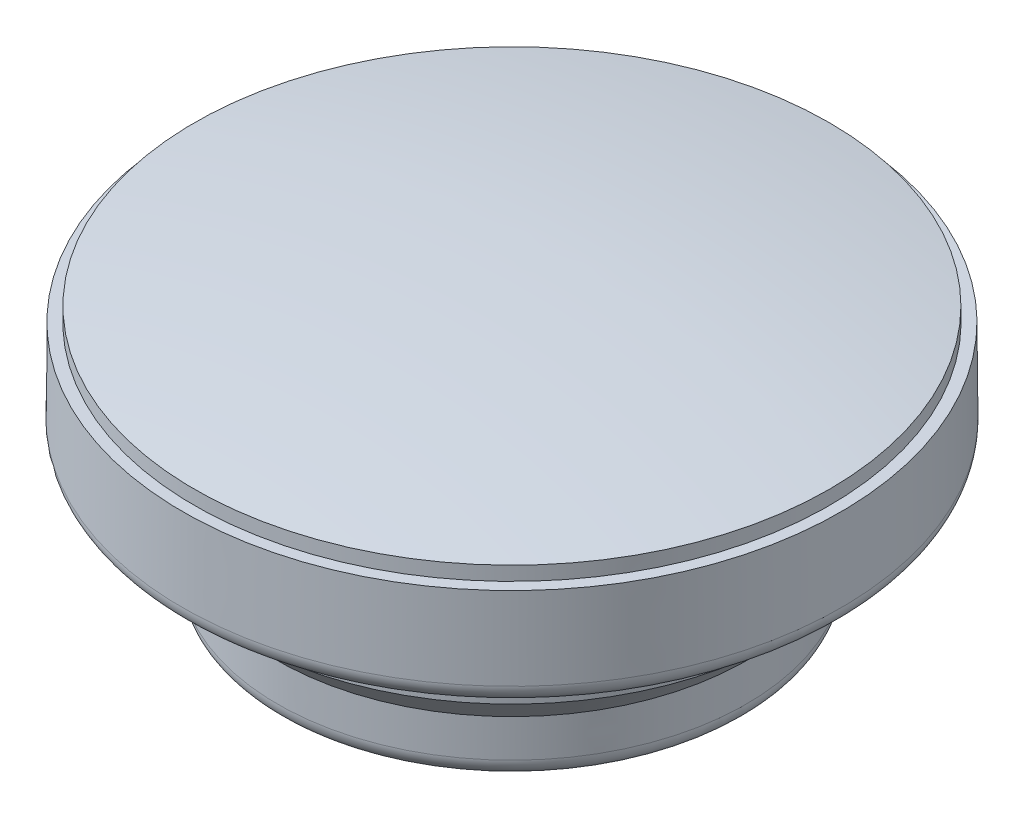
ISO-10303-21;
HEADER;
FILE_DESCRIPTION(('STEP AP214'),'2;1');
FILE_NAME('part.step','',(''),(''),'','','');
FILE_SCHEMA(('AUTOMOTIVE_DESIGN { 1 0 10303 214 1 1 1 1 }'));
ENDSEC;
DATA;
#1=APPLICATION_CONTEXT('core data for automotive mechanical design processes');
#2=APPLICATION_PROTOCOL_DEFINITION('international standard','automotive_design',2000,#1);
#3=PRODUCT_CONTEXT('',#1,'mechanical');
#4=PRODUCT('Part','Part','',(#3));
#5=PRODUCT_RELATED_PRODUCT_CATEGORY('part','',(#4));
#6=PRODUCT_DEFINITION_FORMATION('','',#4);
#7=PRODUCT_DEFINITION_CONTEXT('part definition',#1,'design');
#8=PRODUCT_DEFINITION('design','',#6,#7);
#9=PRODUCT_DEFINITION_SHAPE('','',#8);
#10=(LENGTH_UNIT() NAMED_UNIT(*) SI_UNIT(.MILLI.,.METRE.));
#11=(NAMED_UNIT(*) PLANE_ANGLE_UNIT() SI_UNIT($,.RADIAN.));
#12=(NAMED_UNIT(*) SI_UNIT($,.STERADIAN.) SOLID_ANGLE_UNIT());
#13=UNCERTAINTY_MEASURE_WITH_UNIT(LENGTH_MEASURE(1.E-05),#10,'distance_accuracy_value','');
#14=(GEOMETRIC_REPRESENTATION_CONTEXT(3) GLOBAL_UNCERTAINTY_ASSIGNED_CONTEXT((#13)) GLOBAL_UNIT_ASSIGNED_CONTEXT((#10,
#11,#12)) REPRESENTATION_CONTEXT('',''));
#15=CARTESIAN_POINT('',(0.,0.,0.));
#16=DIRECTION('',(0.,0.,1.));
#17=DIRECTION('',(1.,0.,0.));
#18=AXIS2_PLACEMENT_3D('',#15,#16,#17);
#19=CARTESIAN_POINT('',(3.33066907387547E-13,-49.9999999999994,-8.88178419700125E-13));
#20=DIRECTION('',(0.,-1.,0.));
#21=DIRECTION('',(1.00000000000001,0.,0.));
#22=AXIS2_PLACEMENT_3D('',#19,#20,#21);
#23=SPHERICAL_SURFACE('',#22,50.);
#24=CARTESIAN_POINT('',(-4.9960036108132E-13,-0.723172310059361,0.));
#25=DIRECTION('',(0.,-1.,0.));
#26=DIRECTION('',(0.,0.,-1.00000000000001));
#27=AXIS2_PLACEMENT_3D('',#24,#25,#26);
#28=CIRCLE('',#27,8.47314893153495);
#29=CARTESIAN_POINT('',(-5.04774257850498E-13,-0.72317231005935,-8.473148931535));
#30=VERTEX_POINT('',#29);
#31=EDGE_CURVE('E82',#30,#30,#28,.T.);
#32=ORIENTED_EDGE('',*,*,#31,.F.);
#33=EDGE_LOOP('',(#32));
#34=FACE_BOUND('',#33,.T.);
#35=ADVANCED_FACE('F30',(#34),#23,.T.);
#36=CARTESIAN_POINT('',(3.33066907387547E-13,-49.9999999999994,-8.88178419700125E-13));
#37=DIRECTION('',(0.,-1.,0.));
#38=DIRECTION('',(1.00000000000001,0.,0.));
#39=AXIS2_PLACEMENT_3D('',#36,#37,#38);
#40=SPHERICAL_SURFACE('',#39,47.);
#41=CARTESIAN_POINT('',(-1.66533453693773E-13,-3.14791410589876,-5.55111512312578E-13));
#42=DIRECTION('',(0.,-1.,0.));
#43=DIRECTION('',(0.,0.,-1.00000000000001));
#44=AXIS2_PLACEMENT_3D('',#41,#42,#43);
#45=CIRCLE('',#44,3.72586196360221);
#46=CARTESIAN_POINT('',(-1.68808549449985E-13,-3.14791410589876,-3.72586196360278));
#47=VERTEX_POINT('',#46);
#48=EDGE_CURVE('E10',#47,#47,#45,.T.);
#49=ORIENTED_EDGE('',*,*,#48,.T.);
#50=EDGE_LOOP('',(#49));
#51=FACE_BOUND('',#50,.T.);
#52=ADVANCED_FACE('F90',(#51),#40,.F.);
#53=CARTESIAN_POINT('',(3.33066907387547E-13,-3.1860909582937,-1.11022302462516E-13));
#54=DIRECTION('',(0.,-1.,0.));
#55=DIRECTION('',(0.,0.,-1.00000000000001));
#56=AXIS2_PLACEMENT_3D('',#53,#54,#55);
#57=CONICAL_SURFACE('',#56,4.17826761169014,0.0174532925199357);
#58=CARTESIAN_POINT('',(-2.22044604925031E-13,-6.80436293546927,0.));
#59=DIRECTION('',(0.,1.,0.));
#60=DIRECTION('',(0.,0.,1.00000000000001));
#61=AXIS2_PLACEMENT_3D('',#58,#59,#60);
#62=CIRCLE('',#61,4.24142478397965);
#63=CARTESIAN_POINT('',(-2.19454694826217E-13,-6.80436293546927,4.24142478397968));
#64=VERTEX_POINT('',#63);
#65=EDGE_CURVE('E49',#64,#64,#62,.F.);
#66=ORIENTED_EDGE('',*,*,#65,.T.);
#67=EDGE_LOOP('',(#66));
#68=FACE_BOUND('',#67,.T.);
#69=CARTESIAN_POINT('',(-4.44089209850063E-13,-3.63761434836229,-5.55111512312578E-13));
#70=DIRECTION('',(0.,-1.,0.));
#71=DIRECTION('',(0.,0.,-1.00000000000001));
#72=AXIS2_PLACEMENT_3D('',#69,#70,#71);
#73=CIRCLE('',#72,4.18614898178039);
#74=CARTESIAN_POINT('',(-4.46645367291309E-13,-3.63761434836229,-4.18614898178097));
#75=VERTEX_POINT('',#74);
#76=EDGE_CURVE('E52',#75,#75,#73,.F.);
#77=ORIENTED_EDGE('',*,*,#76,.T.);
#78=EDGE_LOOP('',(#77));
#79=FACE_BOUND('',#78,.T.);
#80=ADVANCED_FACE('F94',(#68,#79),#57,.F.);
#81=CARTESIAN_POINT('',(6.24999999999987,-7.29563673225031,0.));
#82=DIRECTION('',(0.,-1.,0.));
#83=DIRECTION('',(0.,0.,-1.00000000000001));
#84=AXIS2_PLACEMENT_3D('',#81,#82,#83);
#85=PLANE('',#84);
#86=CARTESIAN_POINT('',(0.,-7.29563673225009,-1.11022302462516E-13));
#87=DIRECTION('',(0.,-1.,0.));
#88=DIRECTION('',(0.,0.,-1.00000000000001));
#89=AXIS2_PLACEMENT_3D('',#86,#87,#88);
#90=CIRCLE('',#89,4.74134863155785);
#91=CARTESIAN_POINT('',(0.,-7.29563673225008,-4.74134863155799));
#92=VERTEX_POINT('',#91);
#93=EDGE_CURVE('E40',#92,#92,#90,.F.);
#94=ORIENTED_EDGE('',*,*,#93,.T.);
#95=EDGE_LOOP('',(#94));
#96=FACE_BOUND('',#95,.T.);
#97=CARTESIAN_POINT('',(0.,-7.29563673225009,-1.11022302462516E-13));
#98=DIRECTION('',(0.,-1.,0.));
#99=DIRECTION('',(0.,0.,-1.00000000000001));
#100=AXIS2_PLACEMENT_3D('',#97,#98,#99);
#101=CIRCLE('',#100,5.75434439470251);
#102=CARTESIAN_POINT('',(0.,-7.29563673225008,-5.75434439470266));
#103=VERTEX_POINT('',#102);
#104=EDGE_CURVE('E44',#103,#103,#101,.T.);
#105=ORIENTED_EDGE('',*,*,#104,.T.);
#106=EDGE_LOOP('',(#105));
#107=FACE_BOUND('',#106,.T.);
#108=ADVANCED_FACE('F98',(#96,#107),#85,.T.);
#109=CARTESIAN_POINT('',(0.,-7.29563673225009,-1.11022302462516E-13));
#110=DIRECTION('',(0.,1.,0.));
#111=DIRECTION('',(0.,0.,1.00000000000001));
#112=AXIS2_PLACEMENT_3D('',#109,#110,#111);
#113=CONICAL_SURFACE('',#112,6.25,0.00872664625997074);
#114=CARTESIAN_POINT('',(-2.22044604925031E-13,-6.79999999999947,-4.44089209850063E-13));
#115=DIRECTION('',(0.,-1.,0.));
#116=DIRECTION('',(0.,0.,-1.00000000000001));
#117=AXIS2_PLACEMENT_3D('',#114,#115,#116);
#118=CIRCLE('',#117,6.2543253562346);
#119=CARTESIAN_POINT('',(-2.25863637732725E-13,-6.79999999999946,-6.25432535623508));
#120=VERTEX_POINT('',#119);
#121=EDGE_CURVE('E36',#120,#120,#118,.F.);
#122=ORIENTED_EDGE('',*,*,#121,.T.);
#123=EDGE_LOOP('',(#122));
#124=FACE_BOUND('',#123,.T.);
#125=CARTESIAN_POINT('',(0.,-5.78683286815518,0.));
#126=DIRECTION('',(0.,-1.,0.));
#127=DIRECTION('',(0.,0.,-1.00000000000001));
#128=AXIS2_PLACEMENT_3D('',#125,#126,#127);
#129=CIRCLE('',#128,6.26316713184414);
#130=CARTESIAN_POINT('',(0.,-5.78683286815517,-6.26316713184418));
#131=VERTEX_POINT('',#130);
#132=EDGE_CURVE('E55',#131,#131,#129,.T.);
#133=ORIENTED_EDGE('',*,*,#132,.T.);
#134=EDGE_LOOP('',(#133));
#135=FACE_BOUND('',#134,.T.);
#136=ADVANCED_FACE('F104',(#124,#135),#113,.T.);
#137=CARTESIAN_POINT('',(0.,-5.78683286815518,0.));
#138=DIRECTION('',(0.,1.,0.));
#139=DIRECTION('',(0.,0.,1.00000000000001));
#140=AXIS2_PLACEMENT_3D('',#137,#138,#139);
#141=CONICAL_SURFACE('',#140,6.26316713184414,0.785398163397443);
#142=CARTESIAN_POINT('',(-4.44089209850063E-13,-4.79999999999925,2.22044604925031E-13));
#143=DIRECTION('',(0.,-1.,0.));
#144=DIRECTION('',(0.,0.,-1.00000000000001));
#145=AXIS2_PLACEMENT_3D('',#142,#143,#144);
#146=CIRCLE('',#145,7.25);
#147=CARTESIAN_POINT('',(-4.48516224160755E-13,-4.79999999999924,-7.24999999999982));
#148=VERTEX_POINT('',#147);
#149=EDGE_CURVE('E58',#148,#148,#146,.T.);
#150=ORIENTED_EDGE('',*,*,#149,.T.);
#151=EDGE_LOOP('',(#150));
#152=FACE_BOUND('',#151,.T.);
#153=ORIENTED_EDGE('',*,*,#132,.F.);
#154=EDGE_LOOP('',(#153));
#155=FACE_BOUND('',#154,.T.);
#156=ADVANCED_FACE('F108',(#152,#155),#141,.T.);
#157=CARTESIAN_POINT('',(-4.44089209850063E-13,-4.79999999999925,2.22044604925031E-13));
#158=DIRECTION('',(0.,1.,0.));
#159=DIRECTION('',(0.,0.,1.00000000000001));
#160=AXIS2_PLACEMENT_3D('',#157,#158,#159);
#161=CONICAL_SURFACE('',#160,7.25,0.0174532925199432);
#162=CARTESIAN_POINT('',(0.,-3.29999999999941,0.));
#163=DIRECTION('',(0.,-1.,0.));
#164=DIRECTION('',(0.,0.,-1.00000000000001));
#165=AXIS2_PLACEMENT_3D('',#162,#163,#164);
#166=CIRCLE('',#165,7.27618259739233);
#167=CARTESIAN_POINT('',(0.,-3.29999999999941,-7.27618259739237));
#168=VERTEX_POINT('',#167);
#169=EDGE_CURVE('E61',#168,#168,#166,.T.);
#170=ORIENTED_EDGE('',*,*,#169,.T.);
#171=EDGE_LOOP('',(#170));
#172=FACE_BOUND('',#171,.T.);
#173=ORIENTED_EDGE('',*,*,#149,.F.);
#174=EDGE_LOOP('',(#173));
#175=FACE_BOUND('',#174,.T.);
#176=ADVANCED_FACE('F111',(#172,#175),#161,.T.);
#177=CARTESIAN_POINT('',(7.77618259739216,-3.29999999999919,-3.33066907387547E-13));
#178=DIRECTION('',(0.,-1.,0.));
#179=DIRECTION('',(0.,0.,-1.00000000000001));
#180=AXIS2_PLACEMENT_3D('',#177,#178,#179);
#181=PLANE('',#180);
#182=CARTESIAN_POINT('',(0.,-3.29999999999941,0.));
#183=DIRECTION('',(0.,-1.,0.));
#184=DIRECTION('',(0.,0.,-1.00000000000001));
#185=AXIS2_PLACEMENT_3D('',#182,#183,#184);
#186=CIRCLE('',#185,7.77618259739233);
#187=CARTESIAN_POINT('',(0.,-3.2999999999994,-7.77618259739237));
#188=VERTEX_POINT('',#187);
#189=EDGE_CURVE('E64',#188,#188,#186,.T.);
#190=ORIENTED_EDGE('',*,*,#189,.T.);
#191=EDGE_LOOP('',(#190));
#192=FACE_BOUND('',#191,.T.);
#193=ORIENTED_EDGE('',*,*,#169,.F.);
#194=EDGE_LOOP('',(#193));
#195=FACE_BOUND('',#194,.T.);
#196=ADVANCED_FACE('F115',(#192,#195),#181,.T.);
#197=CARTESIAN_POINT('',(0.,-3.29999999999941,0.));
#198=DIRECTION('',(0.,-1.,0.));
#199=DIRECTION('',(0.,0.,-1.00000000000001));
#200=AXIS2_PLACEMENT_3D('',#197,#198,#199);
#201=CONICAL_SURFACE('',#200,7.77618259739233,0.0174532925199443);
#202=CARTESIAN_POINT('',(-3.33066907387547E-13,-3.79999999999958,-1.11022302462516E-13));
#203=DIRECTION('',(0.,-1.,0.));
#204=DIRECTION('',(0.,0.,-1.00000000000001));
#205=AXIS2_PLACEMENT_3D('',#202,#203,#204);
#206=CIRCLE('',#205,7.78491012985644);
#207=CARTESIAN_POINT('',(-3.37820549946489E-13,-3.79999999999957,-7.78491012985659));
#208=VERTEX_POINT('',#207);
#209=EDGE_CURVE('E67',#208,#208,#206,.T.);
#210=ORIENTED_EDGE('',*,*,#209,.T.);
#211=EDGE_LOOP('',(#210));
#212=FACE_BOUND('',#211,.T.);
#213=ORIENTED_EDGE('',*,*,#189,.F.);
#214=EDGE_LOOP('',(#213));
#215=FACE_BOUND('',#214,.T.);
#216=ADVANCED_FACE('F119',(#212,#215),#201,.F.);
#217=CARTESIAN_POINT('',(8.29561752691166,-3.79999999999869,-5.55111512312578E-13));
#218=DIRECTION('',(0.,-1.,0.));
#219=DIRECTION('',(0.,0.,-1.00000000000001));
#220=AXIS2_PLACEMENT_3D('',#217,#218,#219);
#221=PLANE('',#220);
#222=CARTESIAN_POINT('',(-3.33066907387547E-13,-3.79999999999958,-1.11022302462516E-13));
#223=DIRECTION('',(0.,-1.,0.));
#224=DIRECTION('',(0.,0.,-1.00000000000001));
#225=AXIS2_PLACEMENT_3D('',#222,#223,#224);
#226=CIRCLE('',#225,8.29561752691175);
#227=CARTESIAN_POINT('',(-3.38132399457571E-13,-3.79999999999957,-8.29561752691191));
#228=VERTEX_POINT('',#227);
#229=EDGE_CURVE('E70',#228,#228,#226,.T.);
#230=ORIENTED_EDGE('',*,*,#229,.T.);
#231=EDGE_LOOP('',(#230));
#232=FACE_BOUND('',#231,.T.);
#233=ORIENTED_EDGE('',*,*,#209,.F.);
#234=EDGE_LOOP('',(#233));
#235=FACE_BOUND('',#234,.T.);
#236=ADVANCED_FACE('F123',(#232,#235),#221,.T.);
#237=CARTESIAN_POINT('',(0.,-3.29999999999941,0.));
#238=DIRECTION('',(0.,-1.,0.));
#239=DIRECTION('',(0.,0.,-1.00000000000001));
#240=AXIS2_PLACEMENT_3D('',#237,#238,#239);
#241=TOROIDAL_SURFACE('',#240,8.29561752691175,0.500000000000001);
#242=CARTESIAN_POINT('',(0.,-3.29563673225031,-1.11022302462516E-13));
#243=DIRECTION('',(0.,-1.,0.));
#244=DIRECTION('',(0.,0.,-1.00000000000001));
#245=AXIS2_PLACEMENT_3D('',#242,#243,#244);
#246=CIRCLE('',#245,8.79559848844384);
#247=CARTESIAN_POINT('',(0.,-3.2956367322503,-8.795598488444));
#248=VERTEX_POINT('',#247);
#249=EDGE_CURVE('E73',#248,#248,#246,.T.);
#250=ORIENTED_EDGE('',*,*,#249,.T.);
#251=EDGE_LOOP('',(#250));
#252=FACE_BOUND('',#251,.T.);
#253=ORIENTED_EDGE('',*,*,#229,.F.);
#254=EDGE_LOOP('',(#253));
#255=FACE_BOUND('',#254,.T.);
#256=ADVANCED_FACE('F127',(#252,#255),#241,.T.);
#257=CARTESIAN_POINT('',(0.,-3.29563673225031,-1.11022302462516E-13));
#258=DIRECTION('',(0.,-1.,0.));
#259=DIRECTION('',(0.,0.,-1.00000000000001));
#260=AXIS2_PLACEMENT_3D('',#257,#258,#259);
#261=CONICAL_SURFACE('',#260,8.79559848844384,0.00872664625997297);
#262=CARTESIAN_POINT('',(0.,-1.09563673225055,-4.44089209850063E-13));
#263=DIRECTION('',(0.,-1.,0.));
#264=DIRECTION('',(0.,0.,-1.00000000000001));
#265=AXIS2_PLACEMENT_3D('',#262,#263,#264);
#266=CIRCLE('',#265,8.77639937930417);
#267=CARTESIAN_POINT('',(0.,-1.09563673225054,-8.77639937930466));
#268=VERTEX_POINT('',#267);
#269=EDGE_CURVE('E76',#268,#268,#266,.T.);
#270=ORIENTED_EDGE('',*,*,#269,.T.);
#271=EDGE_LOOP('',(#270));
#272=FACE_BOUND('',#271,.T.);
#273=ORIENTED_EDGE('',*,*,#249,.F.);
#274=EDGE_LOOP('',(#273));
#275=FACE_BOUND('',#274,.T.);
#276=ADVANCED_FACE('F131',(#272,#275),#261,.T.);
#277=CARTESIAN_POINT('',(8.77639937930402,-1.09563673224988,-4.44089209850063E-13));
#278=DIRECTION('',(0.,1.,0.));
#279=DIRECTION('',(0.,0.,1.00000000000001));
#280=AXIS2_PLACEMENT_3D('',#277,#278,#279);
#281=PLANE('',#280);
#282=CARTESIAN_POINT('',(0.,-1.09563673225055,-4.44089209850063E-13));
#283=DIRECTION('',(0.,-1.,0.));
#284=DIRECTION('',(0.,0.,-1.00000000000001));
#285=AXIS2_PLACEMENT_3D('',#282,#283,#284);
#286=CIRCLE('',#285,8.47639937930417);
#287=CARTESIAN_POINT('',(0.,-1.09563673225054,-8.47639937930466));
#288=VERTEX_POINT('',#287);
#289=EDGE_CURVE('E79',#288,#288,#286,.T.);
#290=ORIENTED_EDGE('',*,*,#289,.T.);
#291=EDGE_LOOP('',(#290));
#292=FACE_BOUND('',#291,.T.);
#293=ORIENTED_EDGE('',*,*,#269,.F.);
#294=EDGE_LOOP('',(#293));
#295=FACE_BOUND('',#294,.T.);
#296=ADVANCED_FACE('F135',(#292,#295),#281,.T.);
#297=CARTESIAN_POINT('',(0.,-1.09563673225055,-4.44089209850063E-13));
#298=DIRECTION('',(0.,-1.,0.));
#299=DIRECTION('',(0.,0.,-1.00000000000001));
#300=AXIS2_PLACEMENT_3D('',#297,#298,#299);
#301=CONICAL_SURFACE('',#300,8.47639937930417,0.0087266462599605);
#302=ORIENTED_EDGE('',*,*,#31,.T.);
#303=EDGE_LOOP('',(#302));
#304=FACE_BOUND('',#303,.T.);
#305=ORIENTED_EDGE('',*,*,#289,.F.);
#306=EDGE_LOOP('',(#305));
#307=FACE_BOUND('',#306,.T.);
#308=ADVANCED_FACE('F86',(#304,#307),#301,.T.);
#309=CARTESIAN_POINT('',(-1.66533453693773E-13,-6.79563673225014,-2.22044604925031E-13));
#310=DIRECTION('',(0.,-1.,0.));
#311=DIRECTION('',(0.,0.,-1.00000000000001));
#312=AXIS2_PLACEMENT_3D('',#309,#310,#311);
#313=TOROIDAL_SURFACE('',#312,4.74134863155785,0.5);
#314=ORIENTED_EDGE('',*,*,#93,.F.);
#315=EDGE_LOOP('',(#314));
#316=FACE_BOUND('',#315,.T.);
#317=ORIENTED_EDGE('',*,*,#65,.F.);
#318=EDGE_LOOP('',(#317));
#319=FACE_BOUND('',#318,.T.);
#320=ADVANCED_FACE('F142',(#316,#319),#313,.T.);
#321=CARTESIAN_POINT('',(-1.66533453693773E-13,-6.79563673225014,-2.22044604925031E-13));
#322=DIRECTION('',(0.,-1.,0.));
#323=DIRECTION('',(0.,0.,-1.00000000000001));
#324=AXIS2_PLACEMENT_3D('',#321,#322,#323);
#325=TOROIDAL_SURFACE('',#324,5.75434439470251,0.5);
#326=ORIENTED_EDGE('',*,*,#121,.F.);
#327=EDGE_LOOP('',(#326));
#328=FACE_BOUND('',#327,.T.);
#329=ORIENTED_EDGE('',*,*,#104,.F.);
#330=EDGE_LOOP('',(#329));
#331=FACE_BOUND('',#330,.T.);
#332=ADVANCED_FACE('F145',(#328,#331),#325,.T.);
#333=CARTESIAN_POINT('',(-2.77555756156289E-13,-3.64634055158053,-3.33066907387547E-13));
#334=DIRECTION('',(0.,-1.,0.));
#335=DIRECTION('',(0.,0.,-1.00000000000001));
#336=AXIS2_PLACEMENT_3D('',#333,#334,#335);
#337=TOROIDAL_SURFACE('',#336,3.68622513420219,0.5);
#338=ORIENTED_EDGE('',*,*,#76,.F.);
#339=EDGE_LOOP('',(#338));
#340=FACE_BOUND('',#339,.T.);
#341=ORIENTED_EDGE('',*,*,#48,.F.);
#342=EDGE_LOOP('',(#341));
#343=FACE_BOUND('',#342,.T.);
#344=ADVANCED_FACE('F149',(#340,#343),#337,.F.);
#345=CLOSED_SHELL('',(#35,#52,#80,#108,#136,#156,#176,#196,#216,#236,#256,#276,#296,#308,#320,
#332,#344));
#346=MANIFOLD_SOLID_BREP('B2',#345);
#347=ADVANCED_BREP_SHAPE_REPRESENTATION('',(#18,#346),#14);
#348=SHAPE_DEFINITION_REPRESENTATION(#9,#347);
ENDSEC;
END-ISO-10303-21;
